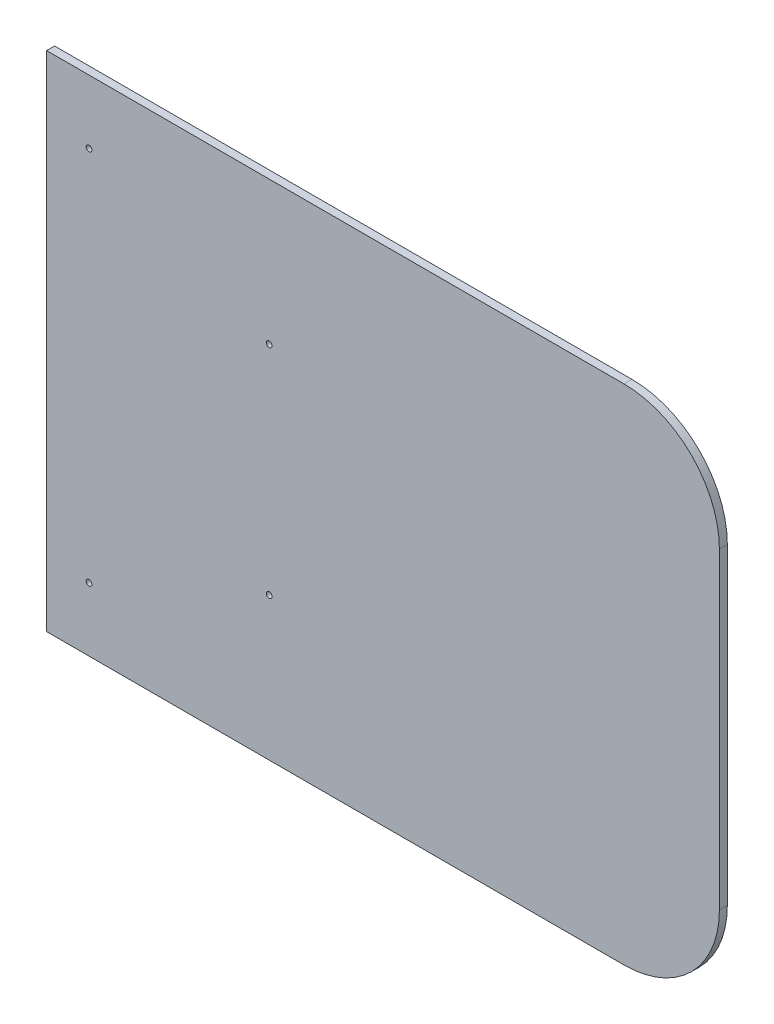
from build123d import *

# Parameters (mm, degrees)
SKETCH1_W      = 806.45
SKETCH1_H      = 603.25
EXTRUDE1_DEPTH = 4.7625
SKETCH2_R      = 3.429
EXTRUDE2_DEPTH = 504.64547737
FILLET1_R      = 114.3


with BuildPart() as part:
    # Sketch1 → Extrude1 (new, symmetric)
    with BuildSketch(Plane.XY):
        Rectangle(SKETCH1_W, SKETCH1_H)
    extrude(amount=EXTRUDE1_DEPTH, both=True)

    # Sketch2 → Extrude2 (cut, through all)
    with BuildSketch(Plane.XY.offset(4.7625)):
        with Locations((-352.425, 225.425)):
            Circle(SKETCH2_R)
        with Locations((-352.425, -225.425)):
            Circle(SKETCH2_R)
        with Locations((-136.525, -130.175)):
            Circle(SKETCH2_R)
        with Locations((-136.525, 130.175)):
            Circle(SKETCH2_R)
    extrude(amount=-EXTRUDE2_DEPTH, mode=Mode.SUBTRACT)

    # Fillet1
    fillet1_edges = [part.edges().sort_by_distance(p)[0] for p in [
        (403.225, -301.625, 0),
        (403.225, 301.625, 0),
    ]]
    fillet(fillet1_edges, radius=FILLET1_R)


solid = part.part
